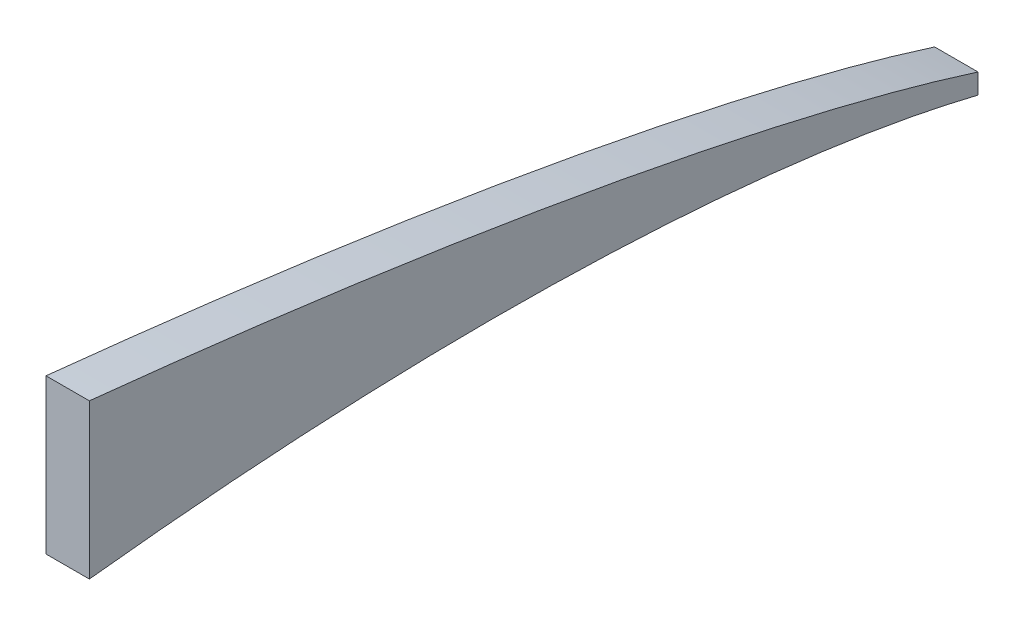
from build123d import *

# Parameters (mm, degrees)
BOSS_EXTRUDE1_DEPTH = 3.175


with BuildPart() as part:
    # Sketch1 → Boss-Extrude1 (new body)
    with BuildSketch(Plane(origin=(0, 0, 0), x_dir=(0, 0, -1), z_dir=(1, 0, 0))):
        with BuildLine():
            Line((68.2625, 18.347143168), (68.2625, 7.040859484))
            add(Edge.make_bspline(
                [(68.2625, 7.040859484), (69.781986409, 7.210393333), (73.625044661, 7.611443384), (79.802913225, 8.133881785), (86.774359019, 8.550290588), (93.686413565, 8.778153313), (100.464089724, 8.804901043), (107.031771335, 8.628583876), (113.314255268, 8.253302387), (119.235995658, 7.683896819), (124.726495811, 6.942169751), (129.386341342, 6.108296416), (132.199931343, 5.478786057), (133.35, 5.195481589)],
                knots=[0.741102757, 0.741102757, 0.741102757, 0.741102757, 0.756094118, 0.778988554, 0.801889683, 0.824566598, 0.846792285, 0.868338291, 0.888978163, 0.908492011, 0.926658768, 0.943286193, 0.95490306, 0.95490306, 0.95490306, 0.95490306], degree=3))
            Line((133.35, 5.195481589), (133.35, 6.663698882))
            add(Edge.make_bspline(
                [(133.35, 6.663698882), (133.02843555, 6.766752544), (131.624319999, 7.209070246), (129.022322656, 7.973635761), (125.436266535, 8.937485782), (121.543710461, 9.898500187), (117.366970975, 10.849724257), (112.930942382, 11.785217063), (108.262713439, 12.700167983), (103.389565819, 13.58332839), (98.342188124, 14.433428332), (93.149666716, 15.239533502), (87.845584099, 16.003202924), (82.463932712, 16.718387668), (77.043692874, 17.382791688), (72.305689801, 17.923740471), (69.378274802, 18.233153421), (68.2625, 18.347143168)],
                knots=[1.047399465, 1.047399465, 1.047399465, 1.047399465, 1.050710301, 1.061833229, 1.07398925, 1.087118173, 1.101145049, 1.115990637, 1.131570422, 1.147788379, 1.164550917, 1.181757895, 1.199311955, 1.217095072, 1.234990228, 1.252856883, 1.263854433, 1.263854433, 1.263854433, 1.263854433], degree=3))
        make_face()
    extrude(amount=BOSS_EXTRUDE1_DEPTH)


solid = part.part
